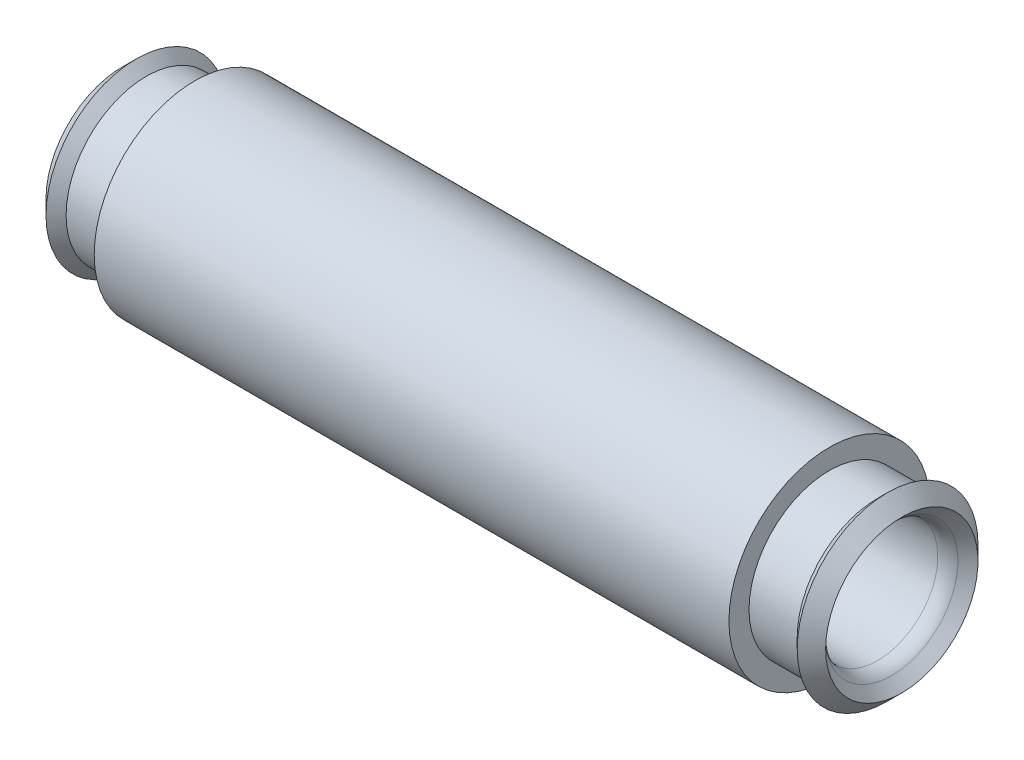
ISO-10303-21;
HEADER;
FILE_DESCRIPTION(('STEP AP214'),'2;1');
FILE_NAME('part.step','',(''),(''),'','','');
FILE_SCHEMA(('AUTOMOTIVE_DESIGN { 1 0 10303 214 1 1 1 1 }'));
ENDSEC;
DATA;
#1=APPLICATION_CONTEXT('core data for automotive mechanical design processes');
#2=APPLICATION_PROTOCOL_DEFINITION('international standard','automotive_design',2000,#1);
#3=PRODUCT_CONTEXT('',#1,'mechanical');
#4=PRODUCT('Part','Part','',(#3));
#5=PRODUCT_RELATED_PRODUCT_CATEGORY('part','',(#4));
#6=PRODUCT_DEFINITION_FORMATION('','',#4);
#7=PRODUCT_DEFINITION_CONTEXT('part definition',#1,'design');
#8=PRODUCT_DEFINITION('design','',#6,#7);
#9=PRODUCT_DEFINITION_SHAPE('','',#8);
#10=(LENGTH_UNIT() NAMED_UNIT(*) SI_UNIT(.MILLI.,.METRE.));
#11=(NAMED_UNIT(*) PLANE_ANGLE_UNIT() SI_UNIT($,.RADIAN.));
#12=(NAMED_UNIT(*) SI_UNIT($,.STERADIAN.) SOLID_ANGLE_UNIT());
#13=UNCERTAINTY_MEASURE_WITH_UNIT(LENGTH_MEASURE(1.E-05),#10,'distance_accuracy_value','');
#14=(GEOMETRIC_REPRESENTATION_CONTEXT(3) GLOBAL_UNCERTAINTY_ASSIGNED_CONTEXT((#13)) GLOBAL_UNIT_ASSIGNED_CONTEXT((#10,
#11,#12)) REPRESENTATION_CONTEXT('',''));
#15=CARTESIAN_POINT('',(0.,0.,0.));
#16=DIRECTION('',(0.,0.,1.));
#17=DIRECTION('',(1.,0.,0.));
#18=AXIS2_PLACEMENT_3D('',#15,#16,#17);
#19=CARTESIAN_POINT('',(-4.55,0.,0.));
#20=DIRECTION('',(-1.,0.,0.));
#21=DIRECTION('',(0.,0.,1.));
#22=AXIS2_PLACEMENT_3D('',#19,#20,#21);
#23=CONICAL_SURFACE('',#22,1.,0.785398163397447);
#24=CARTESIAN_POINT('',(-4.675,0.,0.));
#25=DIRECTION('',(-1.,0.,0.));
#26=DIRECTION('',(0.,0.,1.));
#27=AXIS2_PLACEMENT_3D('',#24,#25,#26);
#28=CIRCLE('',#27,1.125);
#29=CARTESIAN_POINT('',(-4.675,0.,1.125));
#30=VERTEX_POINT('',#29);
#31=EDGE_CURVE('E10',#30,#30,#28,.T.);
#32=ORIENTED_EDGE('',*,*,#31,.F.);
#33=EDGE_LOOP('',(#32));
#34=FACE_BOUND('',#33,.T.);
#35=CARTESIAN_POINT('',(-4.55,0.,0.));
#36=DIRECTION('',(-1.,0.,0.));
#37=DIRECTION('',(0.,0.,1.));
#38=AXIS2_PLACEMENT_3D('',#35,#36,#37);
#39=CIRCLE('',#38,1.);
#40=CARTESIAN_POINT('',(-4.55,0.,1.));
#41=VERTEX_POINT('',#40);
#42=EDGE_CURVE('E80',#41,#41,#39,.T.);
#43=ORIENTED_EDGE('',*,*,#42,.T.);
#44=EDGE_LOOP('',(#43));
#45=FACE_BOUND('',#44,.T.);
#46=ADVANCED_FACE('F34',(#34,#45),#23,.T.);
#47=CARTESIAN_POINT('',(-4.675,0.,0.));
#48=DIRECTION('',(1.,0.,0.));
#49=DIRECTION('',(0.,0.,-1.));
#50=AXIS2_PLACEMENT_3D('',#47,#48,#49);
#51=CONICAL_SURFACE('',#50,1.125,0.785398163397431);
#52=CARTESIAN_POINT('',(-4.85177669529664,0.,0.));
#53=DIRECTION('',(-1.,0.,0.));
#54=DIRECTION('',(0.,0.,1.));
#55=AXIS2_PLACEMENT_3D('',#52,#53,#54);
#56=CIRCLE('',#55,0.948223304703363);
#57=CARTESIAN_POINT('',(-4.85177669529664,0.,0.948223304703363));
#58=VERTEX_POINT('',#57);
#59=EDGE_CURVE('E40',#58,#58,#56,.T.);
#60=ORIENTED_EDGE('',*,*,#59,.F.);
#61=EDGE_LOOP('',(#60));
#62=FACE_BOUND('',#61,.T.);
#63=ORIENTED_EDGE('',*,*,#31,.T.);
#64=EDGE_LOOP('',(#63));
#65=FACE_BOUND('',#64,.T.);
#66=ADVANCED_FACE('F153',(#62,#65),#51,.T.);
#67=CARTESIAN_POINT('',(-4.85177669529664,0.,0.));
#68=DIRECTION('',(-1.,0.,0.));
#69=DIRECTION('',(0.,0.,1.));
#70=AXIS2_PLACEMENT_3D('',#67,#68,#69);
#71=CONICAL_SURFACE('',#70,0.948223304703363,0.785398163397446);
#72=CARTESIAN_POINT('',(-4.72677669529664,0.,0.));
#73=DIRECTION('',(-1.,0.,0.));
#74=DIRECTION('',(0.,0.,1.));
#75=AXIS2_PLACEMENT_3D('',#72,#73,#74);
#76=CIRCLE('',#75,0.823223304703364);
#77=CARTESIAN_POINT('',(-4.72677669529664,0.,0.823223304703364));
#78=VERTEX_POINT('',#77);
#79=EDGE_CURVE('E44',#78,#78,#76,.T.);
#80=ORIENTED_EDGE('',*,*,#79,.F.);
#81=EDGE_LOOP('',(#80));
#82=FACE_BOUND('',#81,.T.);
#83=ORIENTED_EDGE('',*,*,#59,.T.);
#84=EDGE_LOOP('',(#83));
#85=FACE_BOUND('',#84,.T.);
#86=ADVANCED_FACE('F148',(#82,#85),#71,.F.);
#87=CARTESIAN_POINT('',(-4.55,0.,0.));
#88=DIRECTION('',(-1.,0.,0.));
#89=DIRECTION('',(0.,0.,1.));
#90=AXIS2_PLACEMENT_3D('',#87,#88,#89);
#91=TOROIDAL_SURFACE('',#90,1.,0.25);
#92=CARTESIAN_POINT('',(-4.55,0.,0.));
#93=DIRECTION('',(-1.,0.,0.));
#94=DIRECTION('',(0.,0.,1.));
#95=AXIS2_PLACEMENT_3D('',#92,#93,#94);
#96=CIRCLE('',#95,0.75);
#97=CARTESIAN_POINT('',(-4.55,0.,0.75));
#98=VERTEX_POINT('',#97);
#99=EDGE_CURVE('E48',#98,#98,#96,.T.);
#100=ORIENTED_EDGE('',*,*,#99,.F.);
#101=EDGE_LOOP('',(#100));
#102=FACE_BOUND('',#101,.T.);
#103=ORIENTED_EDGE('',*,*,#79,.T.);
#104=EDGE_LOOP('',(#103));
#105=FACE_BOUND('',#104,.T.);
#106=ADVANCED_FACE('F142',(#102,#105),#91,.T.);
#107=CARTESIAN_POINT('',(-108.44530630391,0.,0.));
#108=DIRECTION('',(-1.,0.,0.));
#109=DIRECTION('',(0.,0.,1.));
#110=AXIS2_PLACEMENT_3D('',#107,#108,#109);
#111=CYLINDRICAL_SURFACE('',#110,0.75);
#112=CARTESIAN_POINT('',(4.55,0.,0.));
#113=DIRECTION('',(-1.,0.,0.));
#114=DIRECTION('',(0.,0.,1.));
#115=AXIS2_PLACEMENT_3D('',#112,#113,#114);
#116=CIRCLE('',#115,0.75);
#117=CARTESIAN_POINT('',(4.55,0.,0.75));
#118=VERTEX_POINT('',#117);
#119=EDGE_CURVE('E53',#118,#118,#116,.T.);
#120=ORIENTED_EDGE('',*,*,#119,.F.);
#121=EDGE_LOOP('',(#120));
#122=FACE_BOUND('',#121,.T.);
#123=ORIENTED_EDGE('',*,*,#99,.T.);
#124=EDGE_LOOP('',(#123));
#125=FACE_BOUND('',#124,.T.);
#126=ADVANCED_FACE('F136',(#122,#125),#111,.F.);
#127=CARTESIAN_POINT('',(4.55,0.,0.));
#128=DIRECTION('',(-1.,0.,0.));
#129=DIRECTION('',(0.,0.,1.));
#130=AXIS2_PLACEMENT_3D('',#127,#128,#129);
#131=TOROIDAL_SURFACE('',#130,1.,0.25);
#132=CARTESIAN_POINT('',(4.72677669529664,0.,0.));
#133=DIRECTION('',(-1.,0.,0.));
#134=DIRECTION('',(0.,0.,1.));
#135=AXIS2_PLACEMENT_3D('',#132,#133,#134);
#136=CIRCLE('',#135,0.823223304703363);
#137=CARTESIAN_POINT('',(4.72677669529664,0.,0.823223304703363));
#138=VERTEX_POINT('',#137);
#139=EDGE_CURVE('E56',#138,#138,#136,.T.);
#140=ORIENTED_EDGE('',*,*,#139,.F.);
#141=EDGE_LOOP('',(#140));
#142=FACE_BOUND('',#141,.T.);
#143=ORIENTED_EDGE('',*,*,#119,.T.);
#144=EDGE_LOOP('',(#143));
#145=FACE_BOUND('',#144,.T.);
#146=ADVANCED_FACE('F130',(#142,#145),#131,.T.);
#147=CARTESIAN_POINT('',(4.72677669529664,0.,0.));
#148=DIRECTION('',(1.,0.,0.));
#149=DIRECTION('',(0.,0.,-1.));
#150=AXIS2_PLACEMENT_3D('',#147,#148,#149);
#151=CONICAL_SURFACE('',#150,0.823223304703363,0.785398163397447);
#152=CARTESIAN_POINT('',(4.85177669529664,0.,0.));
#153=DIRECTION('',(-1.,0.,0.));
#154=DIRECTION('',(0.,0.,1.));
#155=AXIS2_PLACEMENT_3D('',#152,#153,#154);
#156=CIRCLE('',#155,0.948223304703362);
#157=CARTESIAN_POINT('',(4.85177669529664,0.,0.948223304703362));
#158=VERTEX_POINT('',#157);
#159=EDGE_CURVE('E59',#158,#158,#156,.T.);
#160=ORIENTED_EDGE('',*,*,#159,.F.);
#161=EDGE_LOOP('',(#160));
#162=FACE_BOUND('',#161,.T.);
#163=ORIENTED_EDGE('',*,*,#139,.T.);
#164=EDGE_LOOP('',(#163));
#165=FACE_BOUND('',#164,.T.);
#166=ADVANCED_FACE('F124',(#162,#165),#151,.F.);
#167=CARTESIAN_POINT('',(4.85177669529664,0.,0.));
#168=DIRECTION('',(-1.,0.,0.));
#169=DIRECTION('',(0.,0.,1.));
#170=AXIS2_PLACEMENT_3D('',#167,#168,#169);
#171=CONICAL_SURFACE('',#170,0.948223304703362,0.785398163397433);
#172=CARTESIAN_POINT('',(4.675,0.,0.));
#173=DIRECTION('',(-1.,0.,0.));
#174=DIRECTION('',(0.,0.,1.));
#175=AXIS2_PLACEMENT_3D('',#172,#173,#174);
#176=CIRCLE('',#175,1.125);
#177=CARTESIAN_POINT('',(4.675,0.,1.125));
#178=VERTEX_POINT('',#177);
#179=EDGE_CURVE('E62',#178,#178,#176,.T.);
#180=ORIENTED_EDGE('',*,*,#179,.F.);
#181=EDGE_LOOP('',(#180));
#182=FACE_BOUND('',#181,.T.);
#183=ORIENTED_EDGE('',*,*,#159,.T.);
#184=EDGE_LOOP('',(#183));
#185=FACE_BOUND('',#184,.T.);
#186=ADVANCED_FACE('F118',(#182,#185),#171,.T.);
#187=CARTESIAN_POINT('',(4.675,0.,0.));
#188=DIRECTION('',(1.,0.,0.));
#189=DIRECTION('',(0.,0.,-1.));
#190=AXIS2_PLACEMENT_3D('',#187,#188,#189);
#191=CONICAL_SURFACE('',#190,1.125,0.785398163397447);
#192=CARTESIAN_POINT('',(4.55,0.,0.));
#193=DIRECTION('',(-1.,0.,0.));
#194=DIRECTION('',(0.,0.,1.));
#195=AXIS2_PLACEMENT_3D('',#192,#193,#194);
#196=CIRCLE('',#195,1.);
#197=CARTESIAN_POINT('',(4.55,0.,1.));
#198=VERTEX_POINT('',#197);
#199=EDGE_CURVE('E65',#198,#198,#196,.T.);
#200=ORIENTED_EDGE('',*,*,#199,.F.);
#201=EDGE_LOOP('',(#200));
#202=FACE_BOUND('',#201,.T.);
#203=ORIENTED_EDGE('',*,*,#179,.T.);
#204=EDGE_LOOP('',(#203));
#205=FACE_BOUND('',#204,.T.);
#206=ADVANCED_FACE('F112',(#202,#205),#191,.T.);
#207=CARTESIAN_POINT('',(-108.44530630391,0.,0.));
#208=DIRECTION('',(-1.,0.,0.));
#209=DIRECTION('',(0.,0.,1.));
#210=AXIS2_PLACEMENT_3D('',#207,#208,#209);
#211=CYLINDRICAL_SURFACE('',#210,1.);
#212=CARTESIAN_POINT('',(3.95,0.,0.));
#213=DIRECTION('',(-1.,0.,0.));
#214=DIRECTION('',(0.,0.,1.));
#215=AXIS2_PLACEMENT_3D('',#212,#213,#214);
#216=CIRCLE('',#215,1.);
#217=CARTESIAN_POINT('',(3.95,0.,1.));
#218=VERTEX_POINT('',#217);
#219=EDGE_CURVE('E68',#218,#218,#216,.T.);
#220=ORIENTED_EDGE('',*,*,#219,.F.);
#221=EDGE_LOOP('',(#220));
#222=FACE_BOUND('',#221,.T.);
#223=ORIENTED_EDGE('',*,*,#199,.T.);
#224=EDGE_LOOP('',(#223));
#225=FACE_BOUND('',#224,.T.);
#226=ADVANCED_FACE('F106',(#222,#225),#211,.T.);
#227=CARTESIAN_POINT('',(3.95,1.25,0.));
#228=DIRECTION('',(-1.,0.,0.));
#229=DIRECTION('',(0.,0.,1.));
#230=AXIS2_PLACEMENT_3D('',#227,#228,#229);
#231=PLANE('',#230);
#232=CARTESIAN_POINT('',(3.95,0.,0.));
#233=DIRECTION('',(-1.,0.,0.));
#234=DIRECTION('',(0.,0.,1.));
#235=AXIS2_PLACEMENT_3D('',#232,#233,#234);
#236=CIRCLE('',#235,1.25);
#237=CARTESIAN_POINT('',(3.95,0.,1.25));
#238=VERTEX_POINT('',#237);
#239=EDGE_CURVE('E71',#238,#238,#236,.T.);
#240=ORIENTED_EDGE('',*,*,#239,.F.);
#241=EDGE_LOOP('',(#240));
#242=FACE_BOUND('',#241,.T.);
#243=ORIENTED_EDGE('',*,*,#219,.T.);
#244=EDGE_LOOP('',(#243));
#245=FACE_BOUND('',#244,.T.);
#246=ADVANCED_FACE('F100',(#242,#245),#231,.F.);
#247=CARTESIAN_POINT('',(-108.44530630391,0.,0.));
#248=DIRECTION('',(-1.,0.,0.));
#249=DIRECTION('',(0.,0.,1.));
#250=AXIS2_PLACEMENT_3D('',#247,#248,#249);
#251=CYLINDRICAL_SURFACE('',#250,1.25);
#252=CARTESIAN_POINT('',(-3.95,0.,0.));
#253=DIRECTION('',(-1.,0.,0.));
#254=DIRECTION('',(0.,0.,1.));
#255=AXIS2_PLACEMENT_3D('',#252,#253,#254);
#256=CIRCLE('',#255,1.25);
#257=CARTESIAN_POINT('',(-3.95,0.,1.25));
#258=VERTEX_POINT('',#257);
#259=EDGE_CURVE('E74',#258,#258,#256,.T.);
#260=ORIENTED_EDGE('',*,*,#259,.F.);
#261=EDGE_LOOP('',(#260));
#262=FACE_BOUND('',#261,.T.);
#263=ORIENTED_EDGE('',*,*,#239,.T.);
#264=EDGE_LOOP('',(#263));
#265=FACE_BOUND('',#264,.T.);
#266=ADVANCED_FACE('F94',(#262,#265),#251,.T.);
#267=CARTESIAN_POINT('',(-3.95,1.25,0.));
#268=DIRECTION('',(1.,0.,0.));
#269=DIRECTION('',(0.,0.,-1.));
#270=AXIS2_PLACEMENT_3D('',#267,#268,#269);
#271=PLANE('',#270);
#272=CARTESIAN_POINT('',(-3.95,0.,0.));
#273=DIRECTION('',(-1.,0.,0.));
#274=DIRECTION('',(0.,0.,1.));
#275=AXIS2_PLACEMENT_3D('',#272,#273,#274);
#276=CIRCLE('',#275,1.);
#277=CARTESIAN_POINT('',(-3.95,0.,1.));
#278=VERTEX_POINT('',#277);
#279=EDGE_CURVE('E77',#278,#278,#276,.T.);
#280=ORIENTED_EDGE('',*,*,#279,.F.);
#281=EDGE_LOOP('',(#280));
#282=FACE_BOUND('',#281,.T.);
#283=ORIENTED_EDGE('',*,*,#259,.T.);
#284=EDGE_LOOP('',(#283));
#285=FACE_BOUND('',#284,.T.);
#286=ADVANCED_FACE('F88',(#282,#285),#271,.F.);
#287=CARTESIAN_POINT('',(-108.44530630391,0.,0.));
#288=DIRECTION('',(-1.,0.,0.));
#289=DIRECTION('',(0.,0.,1.));
#290=AXIS2_PLACEMENT_3D('',#287,#288,#289);
#291=CYLINDRICAL_SURFACE('',#290,1.);
#292=ORIENTED_EDGE('',*,*,#42,.F.);
#293=EDGE_LOOP('',(#292));
#294=FACE_BOUND('',#293,.T.);
#295=ORIENTED_EDGE('',*,*,#279,.T.);
#296=EDGE_LOOP('',(#295));
#297=FACE_BOUND('',#296,.T.);
#298=ADVANCED_FACE('F85',(#294,#297),#291,.T.);
#299=CLOSED_SHELL('',(#46,#66,#86,#106,#126,#146,#166,#186,#206,#226,#246,#266,#286,#298));
#300=MANIFOLD_SOLID_BREP('B2',#299);
#301=ADVANCED_BREP_SHAPE_REPRESENTATION('',(#18,#300),#14);
#302=SHAPE_DEFINITION_REPRESENTATION(#9,#301);
ENDSEC;
END-ISO-10303-21;
